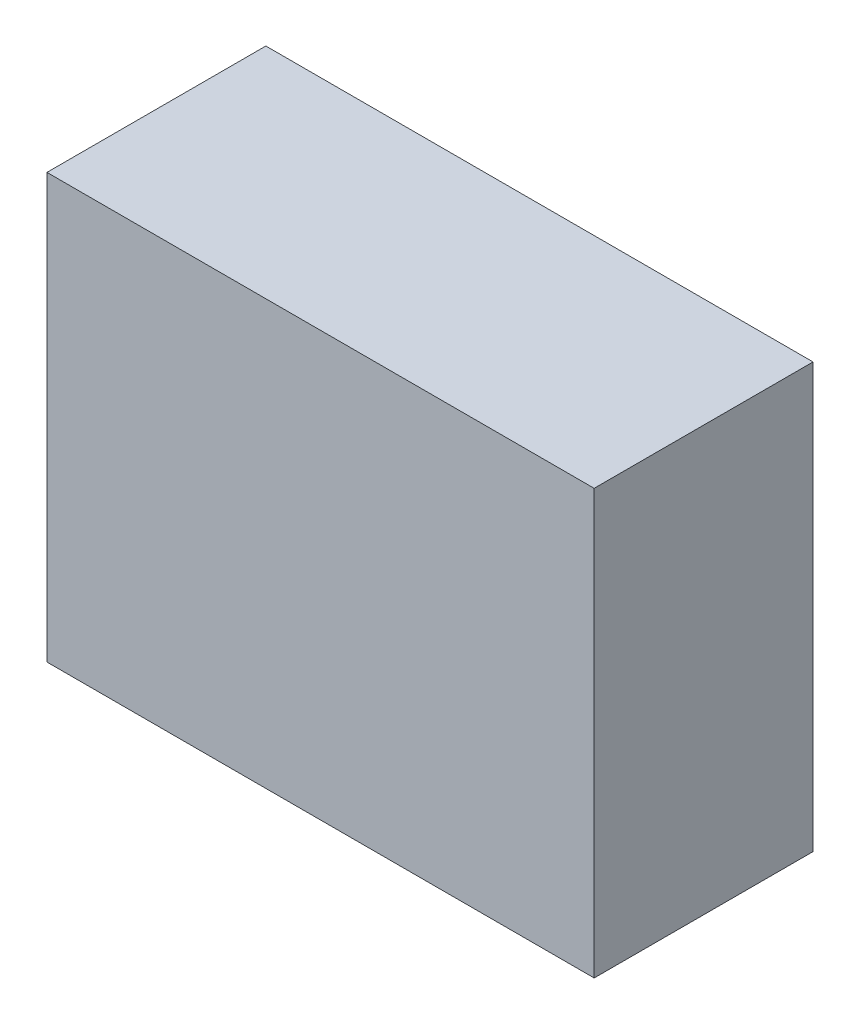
from build123d import *

# Parameters (mm, degrees)
ESQUISSE1_W      = 20
ESQUISSE1_H      = 15.5
EXTRUSION1_DEPTH = 8


with BuildPart() as part:
    # Esquisse1 → Extrusion1 (new body)
    with BuildSketch(Plane.XY):
        with Locations((10, 7.75)):
            Rectangle(ESQUISSE1_W, ESQUISSE1_H)
    extrude(amount=EXTRUSION1_DEPTH)


solid = part.part
